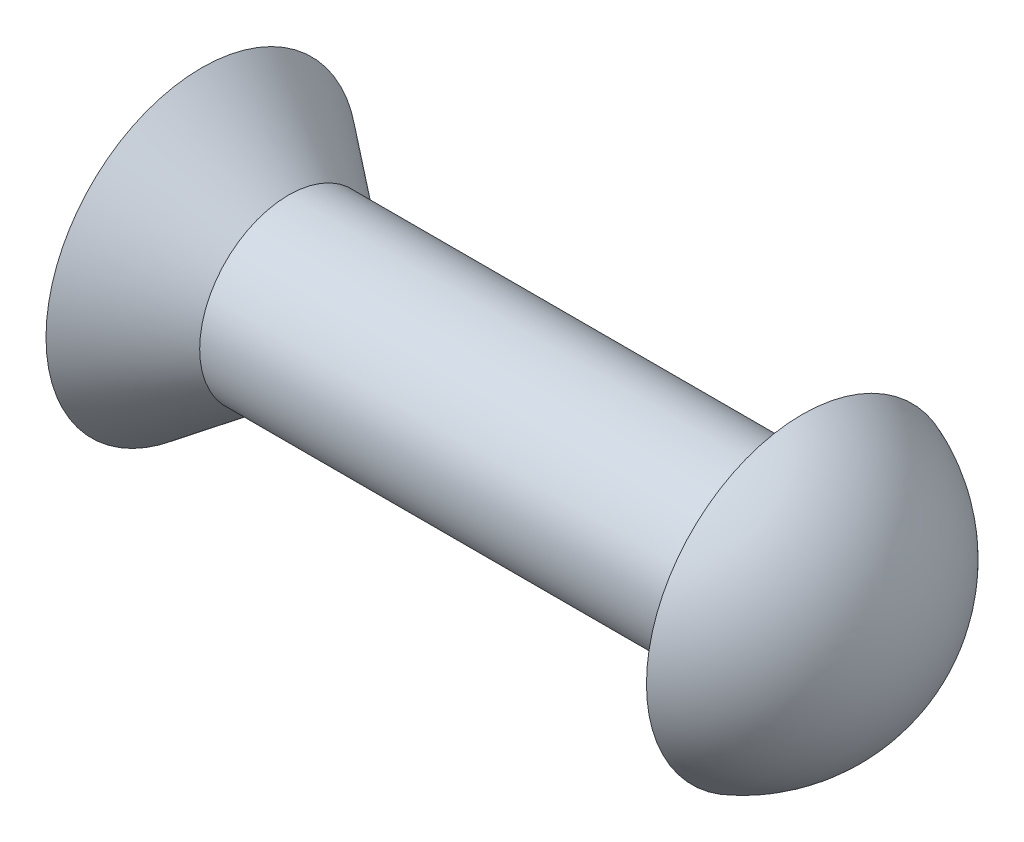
from build123d import *


with BuildPart() as part:
    # Sketch1 → Base-Revolve (revolve)
    with BuildSketch(Plane.XY, mode=Mode.PRIVATE) as base_revolve_sk:
        Polygon((-27, 0), (0, 0), (0, 4), (-23.090323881, 4), (-27, 7), align=None)
    revolve(base_revolve_sk.sketch.rotate(Axis((-34, 0, 0), (1, 0, 0)), 90), axis=Axis((-34, 0, 0), (1, 0, 0)))

    # Sketch2 → HeadTypeA (revolve)
    with BuildSketch(Plane.XY):
        with BuildLine():
            Line((0, 0), (4.8, 0))
            ThreePointArc((4.8, 0), (3.485466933, 4.244320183), (0, 7))
            Line((0, 7), (0, 0))
        make_face()
    revolve(axis=Axis((-32, 0, 0), (1, 0, 0)))


solid = part.part
